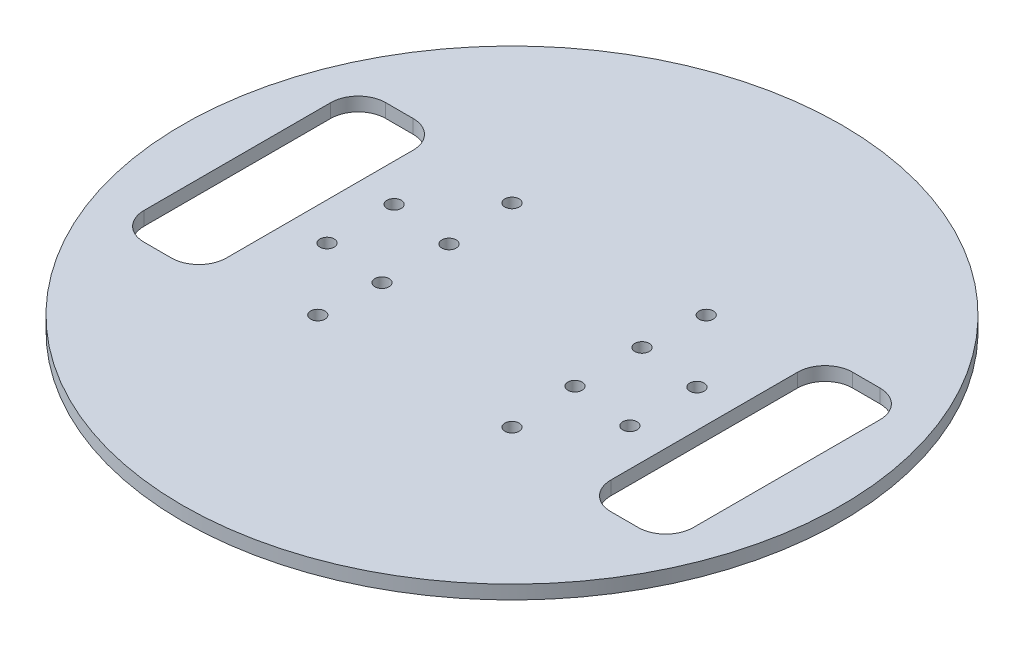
from build123d import *

# Parameters (mm, degrees)
SKETCH1_R      = 152.4
SKETCH1_R_2    = 3.302
EXTRUDE1_DEPTH = 6.35
SKETCH2_R      = 3.302
EXTRUDE3_DEPTH = 216.619670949


with BuildPart() as part:
    # Sketch1 → Extrude1 (new body)
    with BuildSketch(Plane(origin=(0, 0, 0), x_dir=(1, 0, 0), z_dir=(0, 1, 0))):
        with Locations(Location((0, 0, 0), (0, 0, 270))):
            Circle(SKETCH1_R)
        with Locations(Location((-43.03131856, 13.91245376, 0), (0, 0, 270))):
            Circle(SKETCH1_R_2, mode=Mode.SUBTRACT)
        with Locations(Location((-43.03131856, -17.08745376, 0), (0, 0, 270))):
            Circle(SKETCH1_R_2, mode=Mode.SUBTRACT)
        with Locations(Location((-71.60631856, 17.08745376, 0), (0, 0, 270))):
            Circle(SKETCH1_R_2, mode=Mode.SUBTRACT)
        with Locations(Location((-71.60631856, -13.91245376, 0), (0, 0, 270))):
            Circle(SKETCH1_R_2, mode=Mode.SUBTRACT)
        with Locations(Location((43.03131856, -13.91245376, 0), (0, 0, 270))):
            Circle(SKETCH1_R_2, mode=Mode.SUBTRACT)
        with Locations(Location((43.03131856, 17.08745376, 0), (0, 0, 270))):
            Circle(SKETCH1_R_2, mode=Mode.SUBTRACT)
        with Locations(Location((71.60631856, -17.08745376, 0), (0, 0, 270))):
            Circle(SKETCH1_R_2, mode=Mode.SUBTRACT)
        with Locations(Location((71.60631856, 13.91245376, 0), (0, 0, 270))):
            Circle(SKETCH1_R_2, mode=Mode.SUBTRACT)
        with BuildLine():
            Line((-101.6, 55.88), (-114.3, 55.88))
            ThreePointArc((-114.3, 55.88), (-123.280256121, 52.160256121), (-127, 43.18))
            Line((-127, 43.18), (-127, -43.18))
            ThreePointArc((-127, -43.18), (-123.280256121, -52.160256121), (-114.3, -55.88))
            Line((-114.3, -55.88), (-101.6, -55.88))
            ThreePointArc((-101.6, -55.88), (-92.619743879, -52.160256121), (-88.9, -43.18))
            Line((-88.9, -43.18), (-88.9, 43.18))
            ThreePointArc((-88.9, 43.18), (-92.619743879, 52.160256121), (-101.6, 55.88))
        make_face(mode=Mode.SUBTRACT)
        with BuildLine():
            Line((88.9, -43.18), (88.9, 43.18))
            ThreePointArc((88.9, 43.18), (92.619743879, 52.160256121), (101.6, 55.88))
            Line((101.6, 55.88), (114.3, 55.88))
            ThreePointArc((114.3, 55.88), (123.280256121, 52.160256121), (127, 43.18))
            Line((127, 43.18), (127, -43.18))
            ThreePointArc((127, -43.18), (123.280256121, -52.160256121), (114.3, -55.88))
            Line((114.3, -55.88), (101.6, -55.88))
            ThreePointArc((101.6, -55.88), (92.619743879, -52.160256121), (88.9, -43.18))
        make_face(mode=Mode.SUBTRACT)
    extrude(amount=EXTRUDE1_DEPTH)

    # Sketch2 → Extrude3 (cut, through all)
    with BuildSketch(Plane(origin=(0, 6.35, 0), x_dir=(1, 0, 0), z_dir=(0, 1, 0))):
        with Locations((-44.901280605, 44.901280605)):
            Circle(SKETCH2_R)
        with Locations((44.901280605, 44.901280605)):
            Circle(SKETCH2_R)
        with Locations((44.901280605, -44.901280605)):
            Circle(SKETCH2_R)
        with Locations((-44.901280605, -44.901280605)):
            Circle(SKETCH2_R)
    extrude(amount=-EXTRUDE3_DEPTH, mode=Mode.SUBTRACT)


solid = part.part
